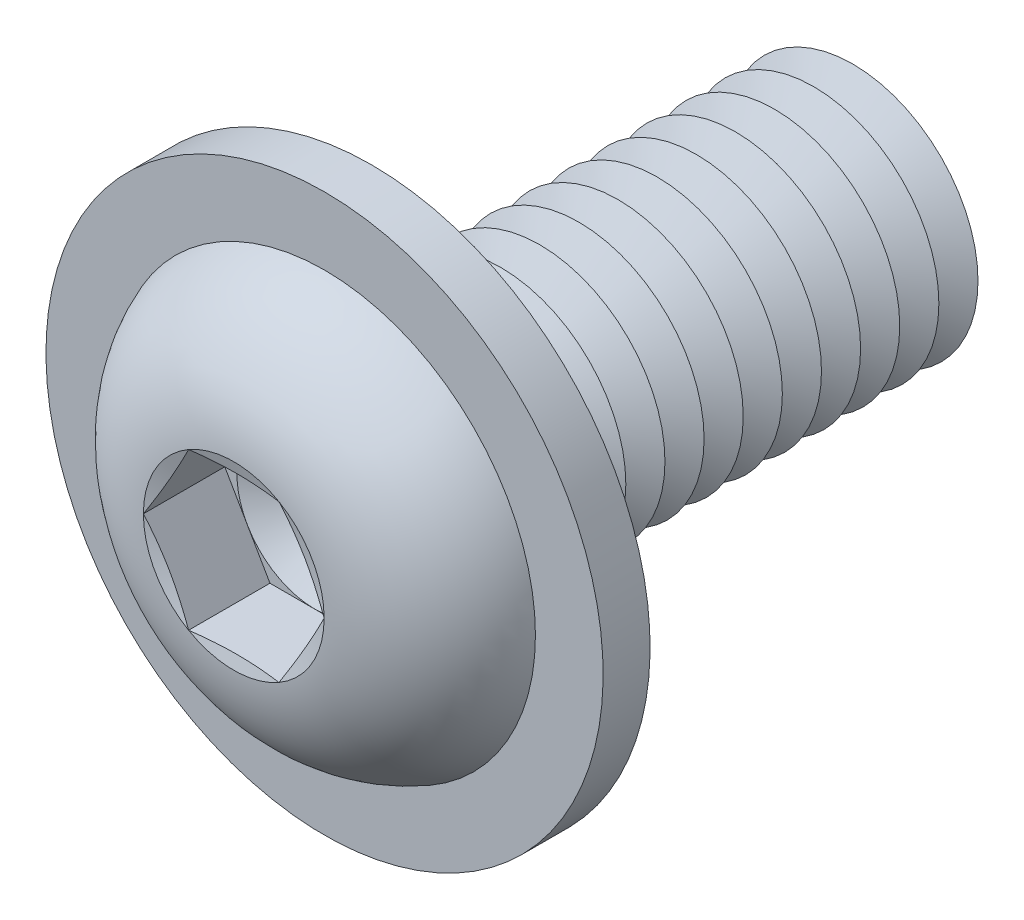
from build123d import *

# Parameters (mm, degrees)
FILLET1_R           = 0.625
LPATTERN1_COUNT     = 12
LPATTERN1_PITCH     = 1.25
CUT_EXTRUDE1_DEPTH  = 2.6
SKETCH5_R           = 8.9
SKETCH5_R_2         = 4.625
BOSS_EXTRUDE1_DEPTH = 1.5


with BuildPart() as part:
    # Sketch1 → Revolve1 (revolve)
    with BuildSketch(Plane(origin=(0, 0, 0), x_dir=(0, 0, -1), z_dir=(1, 0, 0)), mode=Mode.PRIVATE) as revolve1_sk:
        with BuildLine():
            Line((0, 4), (0, 7))
            ThreePointArc((0, 7), (-3.011595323, 5.81154966), (-4.4, 2.88675))
            Line((-4.4, 2.88675), (-4.013248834, 1.443375))
            Line((-4.013248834, 1.443375), (-4.4, 1.443375))
            Line((-4.4, 1.443375), (-4.4, 0))
            Line((-4.4, 0), (16, 0))
            Line((16, 0), (16, 4))
            Line((16, 4), (0, 4))
        make_face()
    revolve(revolve1_sk.sketch.rotate(Axis((0, 0, -16), (0, 0, 1)), 90), axis=Axis((0, 0, -16), (0, 0, 1)))

    # Fillet1
    fillet1_edges = [part.edges().sort_by_distance(p)[0] for p in [
        (4, 0, 0),
    ]]
    fillet(fillet1_edges, radius=FILLET1_R)

    # Sketch2 → Cut-Revolve1 (revolve, cut)
    with BuildSketch(Plane(origin=(0, 0, 0), x_dir=(0, 0, -1), z_dir=(1, 0, 0)), mode=Mode.PRIVATE) as cut_revolve1_sk:
        Polygon((15.375, 4), (16.625, 4), (16, 2.917468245), align=None)
    cut_revolve1 = revolve(cut_revolve1_sk.sketch.rotate(Axis((0, 0, -16), (0, 0, -1)), 270), axis=Axis((0, 0, -16), (0, 0, -1)), mode=Mode.SUBTRACT)

    # LPattern1: Cut-Revolve1 ×12
    with Locations(*[(0, 0, i * LPATTERN1_PITCH) for i in range(1, LPATTERN1_COUNT)]):
        add(cut_revolve1, mode=Mode.SUBTRACT)

    # Sketch3 → Cut-Extrude1 (cut)
    with BuildSketch(Plane.XY.offset(4.4)):
        Polygon((1.443375, 2.499998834), (-1.443375, 2.499998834), (-2.88675, 0), (-1.443375, -2.499998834), (1.443375, -2.499998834), (2.88675, 0), align=None)
    extrude(amount=-CUT_EXTRUDE1_DEPTH, mode=Mode.SUBTRACT)

    # Cut-Extrude2 cone 1 section (on through the dimple's axis) → Cut-Extrude2 (revolve, cut)
    with BuildSketch(Plane(origin=(0, 0, 1.8), x_dir=(0, -1, 0), z_dir=(1, 0, 0))):
        Polygon((0, 0), (2.499998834, 0), (0, 1.443375), align=None)
    revolve(axis=Axis((0, 0, 1.8), (0, 0, -1)), mode=Mode.SUBTRACT)

    # Sketch5 → Boss-Extrude1 (add)
    with BuildSketch(Plane(origin=(0, 0, 0), x_dir=(-1, 0, 0), z_dir=(0, 0, -1))):
        with Locations(Location((0, 0, 0), (0, 0, 90))):
            Circle(SKETCH5_R)
        Circle(SKETCH5_R_2, mode=Mode.SUBTRACT)
    extrude(amount=-BOSS_EXTRUDE1_DEPTH)


solid = part.part
